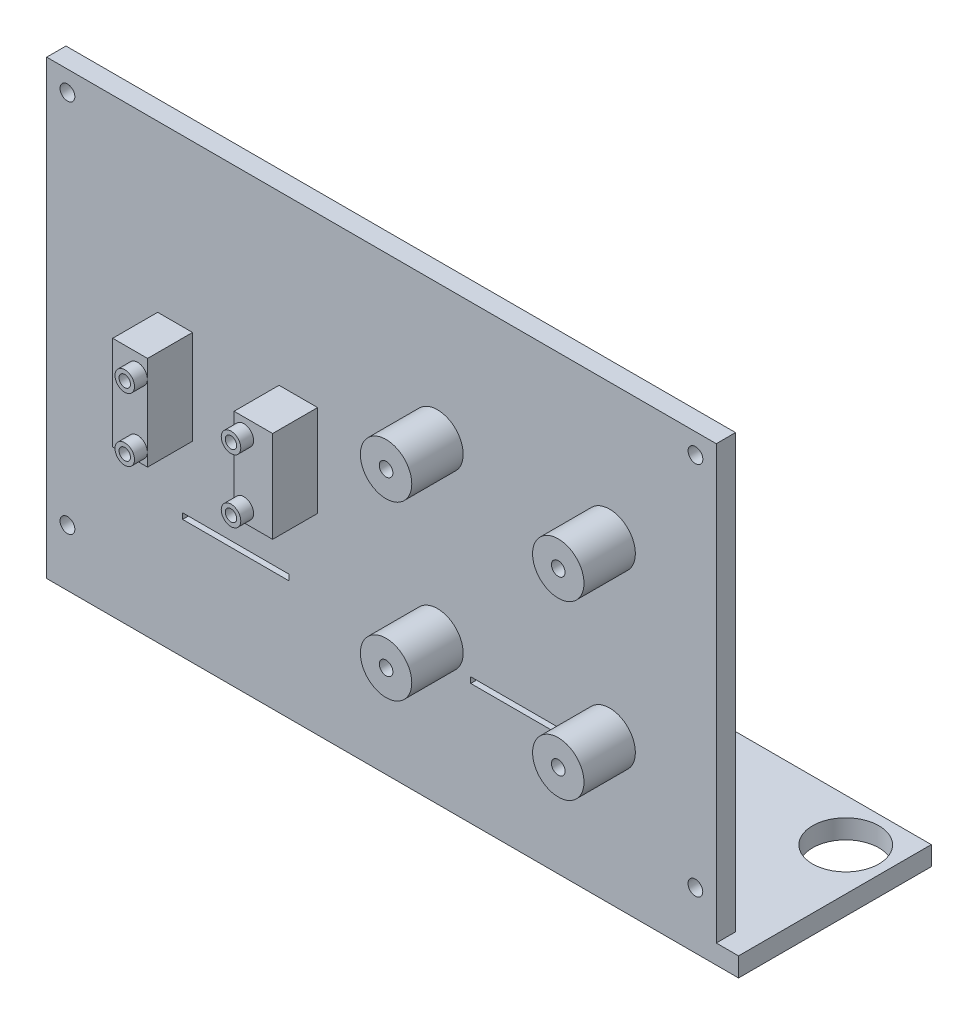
from build123d import *

# Parameters (mm, degrees)
SKETCH2_W                 = 132.345288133
SKETCH2_H                 = 85.473806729
SKETCH2_R                 = 1.3462
SKETCH2_R_2               = 1.1303
SKETCH2_W_2               = 20.99999864
SKETCH2_H_2               = 1.143
BOSS_EXTRUDE2_DEPTH       = 3.81
SKETCH4_R                 = 5.08
SKETCH4_R_2               = 1.3462
BOSS_EXTRUDE8_DEPTH       = 13.97
CUT_EXTRUDE4_DEPTH        = 113.63786916
CUT_EXTRUDE4_DEPTH_BACK   = 113.63786916
SKETCH7_R                 = 1.4605
BOSS_EXTRUDE10_START      = 3.81
SKETCH10_W                = 136.749704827
SKETCH10_H                = 3.787403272
BOSS_EXTRUDE10_DEPTH      = 38.1
SKETCH16_R                = 6.5532
CUT_EXTRUDE8_DEPTH        = 138.903544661
BOSS_EXTRUDE11_DEPTH      = 2.54
BOSS_EXTRUDE11_DEPTH_BACK = 7.62
SKETCH22_W                = 6.893513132
SKETCH22_H                = 18.614670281
SKETCH22_W_2              = 7.62
SKETCH22_H_2              = 18.118632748
BOSS_EXTRUDE12_DEPTH      = 8.89
SKETCH23_R                = 1.9304
BOSS_EXTRUDE13_DEPTH      = 2.54
SKETCH24_R                = 1.1303
CUT_EXTRUDE11_DEPTH       = 121.634608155
SKETCH25_R                = 5.08
CUT_EXTRUDE12_DEPTH       = 1.27
SKETCH26_R                = 3.048
CUT_EXTRUDE14_DEPTH       = 1.27


with BuildPart() as part:
    # Sketch2 → Boss-Extrude2 (new body)
    with BuildSketch(Plane.XY):
        with Locations((32.067042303, 10.56499802)):
            Rectangle(SKETCH2_W, SKETCH2_H)
        with Locations(Location((77.169904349, -7.556834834, 0), (0, 0, 180))):
            Circle(SKETCH2_R, mode=Mode.SUBTRACT)
        with Locations(Location((77.169904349, 26.479165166, 0), (0, 0, 180))):
            Circle(SKETCH2_R, mode=Mode.SUBTRACT)
        with Locations(Location((43.133904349, 26.479165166, 0), (0, 0, 180))):
            Circle(SKETCH2_R, mode=Mode.SUBTRACT)
        with Locations(Location((43.133904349, -7.556834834, 0), (0, 0, 180))):
            Circle(SKETCH2_R, mode=Mode.SUBTRACT)
        with Locations(Location((13.751905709, 17.005504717, 0), (0, 0, 180))):
            Circle(SKETCH2_R_2, mode=Mode.SUBTRACT)
        with Locations(Location((13.751905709, 4.505506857, 0), (0, 0, 180))):
            Circle(SKETCH2_R_2, mode=Mode.SUBTRACT)
        with Locations(Location((-7.248092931, 17.005504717, 0), (0, 0, 180))):
            Circle(SKETCH2_R_2, mode=Mode.SUBTRACT)
        with Locations(Location((-7.248092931, 4.505506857, 0), (0, 0, 180))):
            Circle(SKETCH2_R_2, mode=Mode.SUBTRACT)
        with Locations((60.203180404, -11.434049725)):
            Rectangle(SKETCH2_W_2, SKETCH2_H_2, mode=Mode.SUBTRACT)
        with Locations((3.246238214, -11.831408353)):
            Rectangle(SKETCH2_W_2, SKETCH2_H_2, mode=Mode.SUBTRACT)
    extrude(amount=BOSS_EXTRUDE2_DEPTH)

    # Sketch4 → Boss-Extrude8 (add)
    # profile 1 of 4: a face of its own
    with BuildSketch(Plane.XY):
        with Locations((43.133904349, 26.479165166)):
            Circle(SKETCH4_R)
        with Locations(Location((43.133904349, 26.479165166, 0), (0, 0, 180))):
            Circle(SKETCH4_R_2, mode=Mode.SUBTRACT)
    # profile 2 of 4: a face of its own
    with BuildSketch(Plane.XY):
        with Locations((77.169904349, 26.479165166)):
            Circle(SKETCH4_R)
        with Locations(Location((77.169904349, 26.479165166, 0), (0, 0, 180))):
            Circle(SKETCH4_R_2, mode=Mode.SUBTRACT)
    # profile 3 of 4: a face of its own
    with BuildSketch(Plane.XY):
        with Locations((43.133904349, -7.556834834)):
            Circle(SKETCH4_R)
        with Locations(Location((43.133904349, -7.556834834, 0), (0, 0, 180))):
            Circle(SKETCH4_R_2, mode=Mode.SUBTRACT)
    # profile 4 of 4: a face of its own
    with BuildSketch(Plane.XY):
        with Locations((77.169904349, -7.556834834)):
            Circle(SKETCH4_R)
        with Locations(Location((77.169904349, -7.556834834, 0), (0, 0, 180))):
            Circle(SKETCH4_R_2, mode=Mode.SUBTRACT)
    extrude(amount=BOSS_EXTRUDE8_DEPTH)

    # Sketch7 → Cut-Extrude4 (cut, two sides: drawn at the far end of the back side and taken through both)
    with BuildSketch(Plane.XY.offset(-CUT_EXTRUDE4_DEPTH_BACK)):
        with Locations((94.1119821, -24.75365908)):
            Circle(SKETCH7_R)
        with Locations((94.132735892, 49.294443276)):
            Circle(SKETCH7_R)
        with Locations((-30.007414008, -24.75365908)):
            Circle(SKETCH7_R)
        with Locations((-30.007414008, 49.294443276)):
            Circle(SKETCH7_R)
    extrude(amount=CUT_EXTRUDE4_DEPTH + CUT_EXTRUDE4_DEPTH_BACK, mode=Mode.SUBTRACT)

    # Sketch10 → Boss-Extrude10 (add)
    with BuildSketch(Plane.XY.offset(BOSS_EXTRUDE10_START)):
        with Locations((34.26925065, -34.065606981)):
            Rectangle(SKETCH10_W, SKETCH10_H)
    extrude(amount=-BOSS_EXTRUDE10_DEPTH)

    # Sketch16 → Cut-Extrude8 (cut, through all)
    with BuildSketch(Plane(origin=(0, -32.171905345, 0), x_dir=(1, 0, 0), z_dir=(0, 1, 0))):
        with Locations(Location((-25.691130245, 25.791624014, 0), (0, 0, 270))):
            Circle(SKETCH16_R)
        with Locations(Location((94.229631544, 25.791624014, 0), (0, 0, 270))):
            Circle(SKETCH16_R)
    extrude(amount=-CUT_EXTRUDE8_DEPTH, mode=Mode.SUBTRACT)

    # Sketch21 → Boss-Extrude11 (add, two sides: drawn at the far end of the back side and taken through both)
    with BuildSketch(Plane(origin=(32.067042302, 0, 0), x_dir=(0, 0, -1), z_dir=(1, 0, 0)).offset(-BOSS_EXTRUDE11_DEPTH_BACK)):
        Polygon((0, 53.301901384), (0, -32.171905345), (0.018014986, -32.171905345), (0.018014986, -29.936860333), (19.045688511, -29.936860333), (19.045688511, -32.171905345), (34.29, -32.171905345), align=None)
    extrude(amount=BOSS_EXTRUDE11_DEPTH + BOSS_EXTRUDE11_DEPTH_BACK)

    # Sketch22 → Boss-Extrude12 (add)
    with BuildSketch(Plane.XY.offset(3.81)):
        with Locations((-8.726370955, 11.279259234)):
            Rectangle(SKETCH22_W, SKETCH22_H)
        with Locations((15.631505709, 11.031240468)):
            Rectangle(SKETCH22_W_2, SKETCH22_H_2)
    extrude(amount=BOSS_EXTRUDE12_DEPTH)

    # Sketch23 → Boss-Extrude13 (add)
    with BuildSketch(Plane.XY.offset(12.7)):
        with Locations((-7.248092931, 17.005504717)):
            Circle(SKETCH23_R)
        with Locations((-7.248092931, 4.505506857)):
            Circle(SKETCH23_R)
        with Locations(Location((13.751905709, 17.005504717, 0), (0, 0, 180))):
            Circle(SKETCH23_R)
        with Locations(Location((13.751905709, 4.505506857, 0), (0, 0, 180))):
            Circle(SKETCH23_R)
    extrude(amount=BOSS_EXTRUDE13_DEPTH)

    # Sketch24 → Cut-Extrude11 (cut, through all)
    with BuildSketch(Plane.XY):
        with Locations(Location((-7.248092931, 17.005504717, 0), (0, 0, 180))):
            Circle(SKETCH24_R)
        with Locations(Location((-7.248092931, 4.505506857, 0), (0, 0, 180))):
            Circle(SKETCH24_R)
        with Locations(Location((13.751905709, 17.005504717, 0), (0, 0, 180))):
            Circle(SKETCH24_R)
        with Locations(Location((13.751905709, 4.505506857, 0), (0, 0, 180))):
            Circle(SKETCH24_R)
    extrude(amount=CUT_EXTRUDE11_DEPTH, mode=Mode.SUBTRACT)

    # Sketch25 → Cut-Extrude12 (cut)
    with BuildSketch(Plane.XY):
        with Locations((-7.248092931, 17.005504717)):
            Circle(SKETCH25_R)
        with Locations((-7.248092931, 4.505506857)):
            Circle(SKETCH25_R)
        with Locations((13.751905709, 17.005504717)):
            Circle(SKETCH25_R)
        with Locations((13.751905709, 4.505506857)):
            Circle(SKETCH25_R)
    extrude(amount=CUT_EXTRUDE12_DEPTH, mode=Mode.SUBTRACT)

    # Sketch26 → Cut-Extrude14 (cut)
    with BuildSketch(Plane.XY):
        with Locations((-30.007414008, -24.75365908)):
            Circle(SKETCH26_R)
        with Locations((-30.007414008, 49.294443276)):
            Circle(SKETCH26_R)
        with Locations((94.132735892, 49.294443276)):
            Circle(SKETCH26_R)
        with Locations((94.1119821, -24.75365908)):
            Circle(SKETCH26_R)
    extrude(amount=CUT_EXTRUDE14_DEPTH, mode=Mode.SUBTRACT)


solid = part.part
